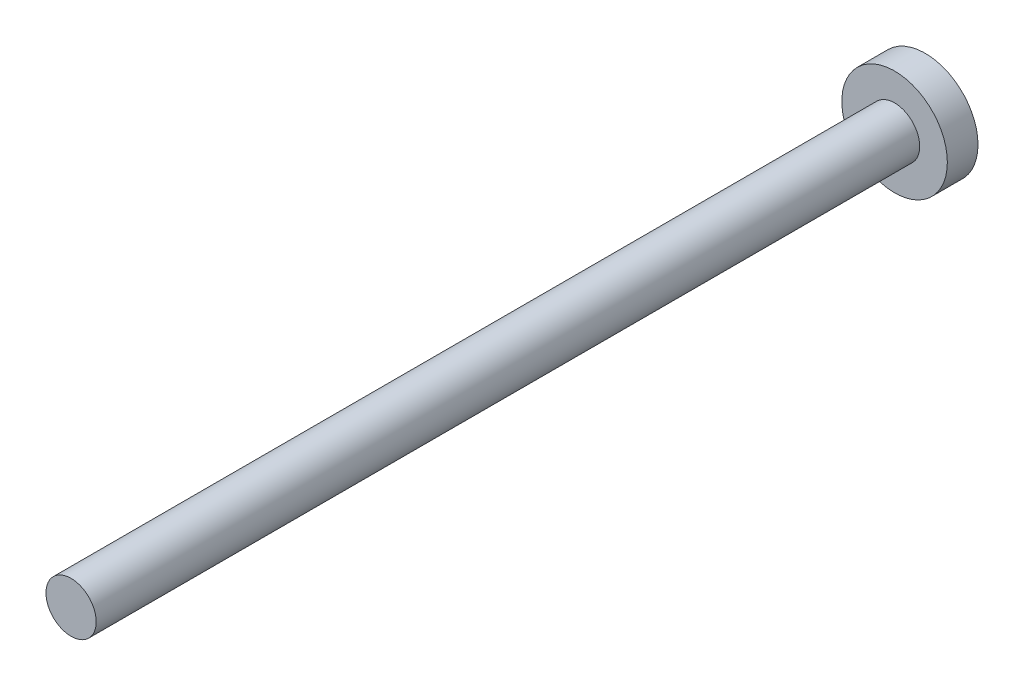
from build123d import *

# Parameters (mm, degrees)
ESQUISSE1_R      = 5.25
EXTRUSION1_DEPTH = 3.05
ESQUISSE2_R      = 2.5
EXTRUSION2_DEPTH = 81.95


with BuildPart() as part:
    # Esquisse1 → Extrusion1 (new body)
    with BuildSketch(Plane.XY):
        Circle(ESQUISSE1_R)
    extrude(amount=EXTRUSION1_DEPTH)

    # Esquisse2 → Extrusion2 (add)
    with BuildSketch(Plane.XY.offset(3.05)):
        Circle(ESQUISSE2_R)
    extrude(amount=EXTRUSION2_DEPTH)


solid = part.part
